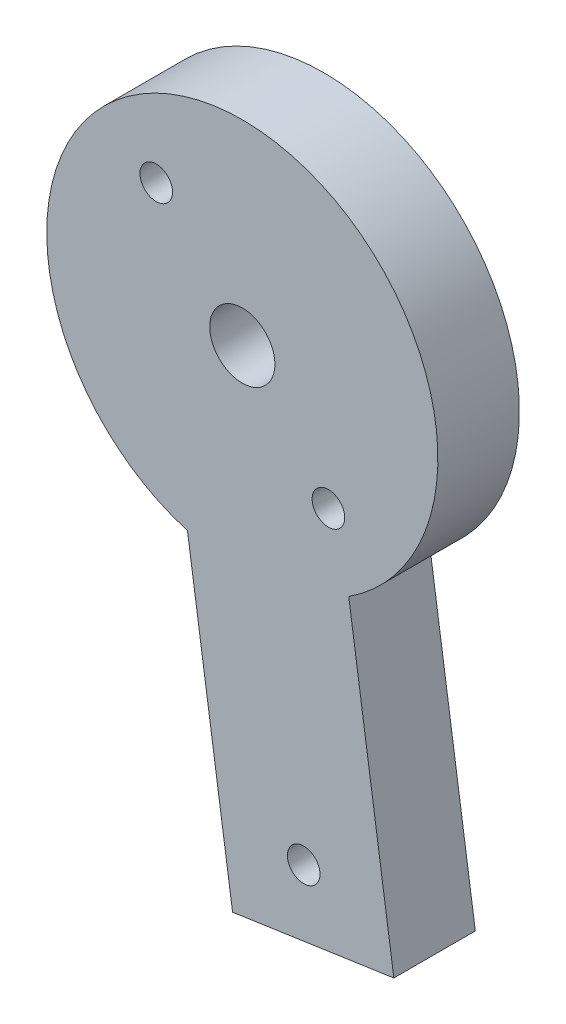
from build123d import *

# Parameters (mm, degrees)
BOSS_EXTRUDE1_DEPTH = 5
SKETCH2_R           = 2
SKETCH2_R_2         = 1
CUT_EXTRUDE1_DEPTH  = 5
SKETCH3_R           = 1
CUT_EXTRUDE2_DEPTH  = 5


with BuildPart() as part:
    # Sketch1 → Boss-Extrude1 (new body)
    with BuildSketch(Plane.XY):
        with BuildLine():
            Line((-3.365772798, -11.518314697), (-0.598155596, -30.407930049))
            Line((-0.598155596, -30.407930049), (9.296208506, -28.958254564))
            Line((9.296208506, -28.958254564), (6.528591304, -10.068639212))
            ThreePointArc((6.528591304, -10.068639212), (-1.739610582, 11.873236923), (-3.365772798, -11.518314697))
        make_face()
    extrude(amount=BOSS_EXTRUDE1_DEPTH)

    # Sketch2 → Cut-Extrude1 (cut)
    with BuildSketch(Plane.XY.offset(5)):
        Circle(SKETCH2_R)
        with Locations((3.76692956, -25.710148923)):
            Circle(SKETCH2_R_2)
    extrude(amount=-CUT_EXTRUDE1_DEPTH, mode=Mode.SUBTRACT)

    # Sketch3 → Cut-Extrude2 (cut)
    with BuildSketch(Plane.XY.offset(5)):
        with Locations((-5.281943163, 6.008417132)):
            Circle(SKETCH3_R)
        with Locations((5.281943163, -6.008417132)):
            Circle(SKETCH3_R)
    extrude(amount=-CUT_EXTRUDE2_DEPTH, mode=Mode.SUBTRACT)


solid = part.part
